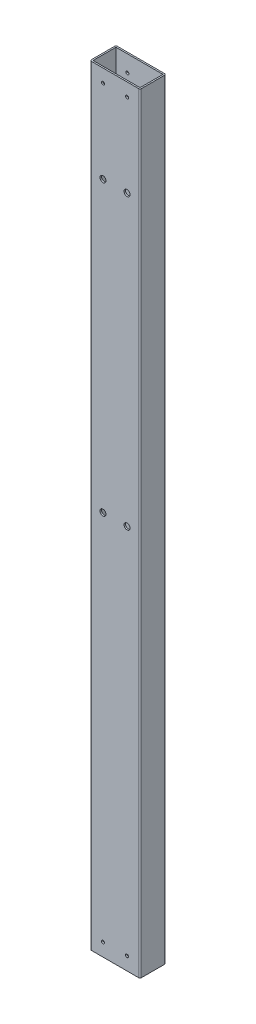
from build123d import *

# Parameters (mm, degrees)
SKETCH1_W           = 49.657
SKETCH1_H           = 24.257
EXTRUDE_THIN1_DEPTH = 406.4
SKETCH2_R           = 3.175
CUT_EXTRUDE1_DEPTH  = 409.180449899
SKETCH3_R           = 1.5875
CUT_EXTRUDE2_DEPTH  = 408.48851973
SKETCH4_R           = 1.5875
CUT_EXTRUDE3_DEPTH  = 408.48851973


with BuildPart() as part:
    # Sketch1 → Extrude-Thin1 (new, symmetric)
    with BuildSketch(Plane(origin=(0, 0, 0), x_dir=(1, 0, 0), z_dir=(0, 1, 0))):
        with BuildLine():
            Line((-26.416, 12.1285), (-26.416, -12.1285))
            ThreePointArc((-26.416, -12.1285), (-25.951032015, -13.251032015), (-24.8285, -13.716))
            Line((-24.8285, -13.716), (24.8285, -13.716))
            ThreePointArc((24.8285, -13.716), (25.951032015, -13.251032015), (26.416, -12.1285))
            Line((26.416, -12.1285), (26.416, 12.1285))
            ThreePointArc((26.416, 12.1285), (25.951032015, 13.251032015), (24.8285, 13.716))
            Line((24.8285, 13.716), (-24.8285, 13.716))
            ThreePointArc((-24.8285, 13.716), (-25.951032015, 13.251032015), (-26.416, 12.1285))
        make_face()
        Rectangle(SKETCH1_W, SKETCH1_H, mode=Mode.SUBTRACT)
    extrude(amount=EXTRUDE_THIN1_DEPTH, both=True)

    # Sketch2 → Cut-Extrude1 (cut, through all)
    with BuildSketch(Plane.XY.offset(13.716)):
        with Locations((-12.7, 0)):
            Circle(SKETCH2_R)
        with Locations((12.7, 0)):
            Circle(SKETCH2_R)
        with Locations((-12.7, 304.8)):
            Circle(SKETCH2_R)
        with Locations((12.7, 304.8)):
            Circle(SKETCH2_R)
    extrude(amount=-CUT_EXTRUDE1_DEPTH, mode=Mode.SUBTRACT)

    # Sketch3 → Cut-Extrude2 (cut, through all)
    with BuildSketch(Plane.XY):
        with Locations(Location((-12.7, 392.557, 0), (0, 0, 180))):
            Circle(SKETCH3_R)
        with Locations(Location((12.7, 392.557, 0), (0, 0, 180))):
            Circle(SKETCH3_R)
        with Locations(Location((12.7, -392.557, 0), (0, 0, 180))):
            Circle(SKETCH3_R)
        with Locations(Location((-12.7, -392.557, 0), (0, 0, 180))):
            Circle(SKETCH3_R)
    extrude(amount=CUT_EXTRUDE2_DEPTH, mode=Mode.SUBTRACT)

    # Sketch4 → Cut-Extrude3 (cut, through all)
    with BuildSketch(Plane.XY):
        with Locations((12.7, -388.9375)):
            Circle(SKETCH4_R)
        with Locations((-12.7, -388.9375)):
            Circle(SKETCH4_R)
        with Locations((-12.7, 388.9375)):
            Circle(SKETCH4_R)
        with Locations((12.7, 388.9375)):
            Circle(SKETCH4_R)
    extrude(amount=-CUT_EXTRUDE3_DEPTH, mode=Mode.SUBTRACT)


solid = part.part
